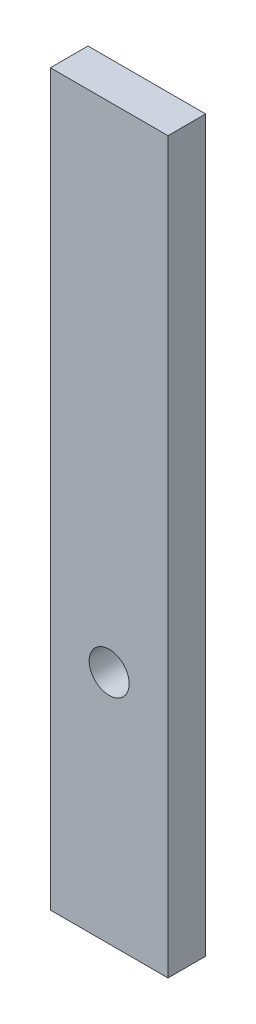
from build123d import *

# Parameters (mm, degrees)
ESQUISSE1_W            = 25
ESQUISSE1_H            = 155
EXTRUSION1_DEPTH       = 8
TROU_TARAUD_M10X1_51_D = 8.5


with BuildPart() as part:
    # Esquisse1 → Extrusion1 (new body)
    with BuildSketch(Plane.XY):
        with Locations((12.5, 77.5)):
            Rectangle(ESQUISSE1_W, ESQUISSE1_H)
    extrude(amount=EXTRUSION1_DEPTH)

    # Trou taraud_ M10x1.51 (through all)
    with Locations(Plane.XY.offset(8)):
        with Locations((12.5, 50)):
            Hole(TROU_TARAUD_M10X1_51_D / 2)


solid = part.part
